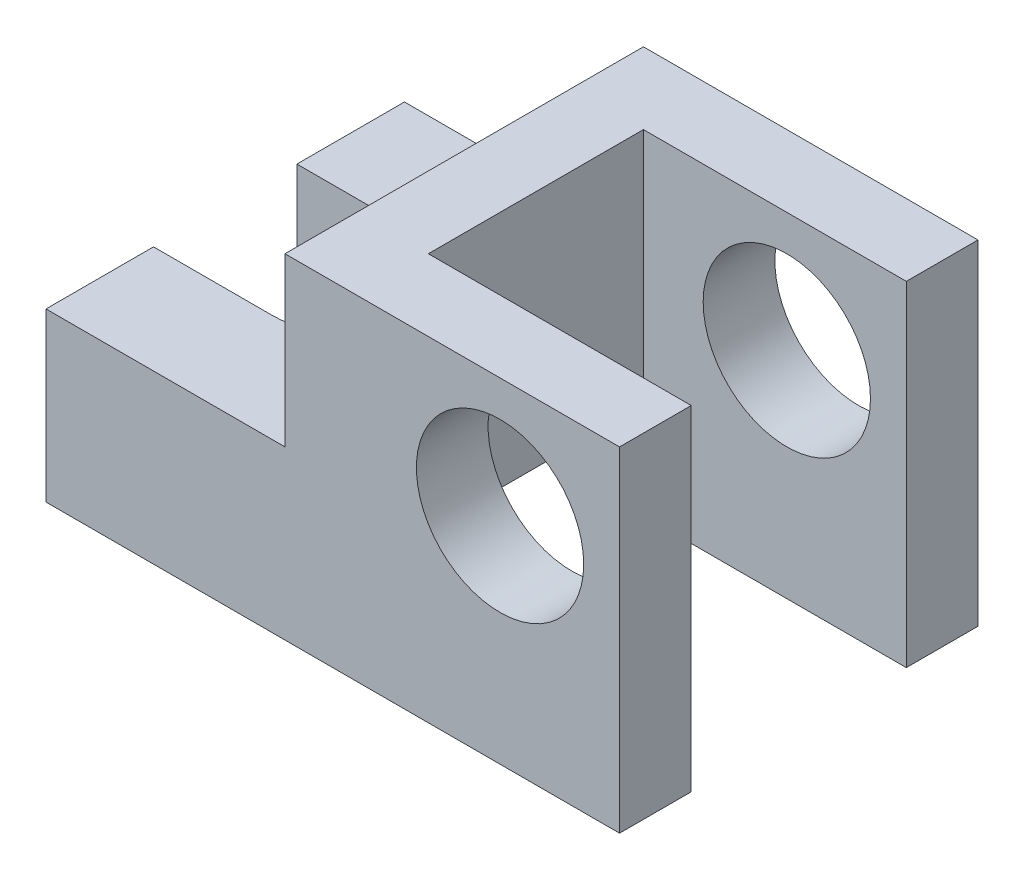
from build123d import *

# Parameters (mm, degrees)
SKETCH_1_W          = 48
SKETCH_1_H          = 30
EXTRUDE_1_DEPTH     = 14
CUT_EXTRUDE_1_DEPTH = 59.309518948
SKETCH_3_W          = 18
SKETCH_3_H          = 8
CUT_EXTRUDE_2_DEPTH = 59.309518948
SKETCH_4_W          = 28
SKETCH_4_H          = 30
EXTRUDE_2_DEPTH     = 14
SKETCH_5_W          = 22
SKETCH_5_H          = 18
CUT_EXTRUDE_3_DEPTH = 64.150613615
SKETCH_6_R          = 7
CUT_EXTRUDE_4_DEPTH = 64.150613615


with BuildPart() as part:
    # Sketch 1 → Extrude 1 (new body)
    with BuildSketch(Plane(origin=(0, 0, 0), x_dir=(1, 0, 0), z_dir=(0, 1, 0))):
        with Locations((24, 15)):
            Rectangle(SKETCH_1_W, SKETCH_1_H)
    extrude(amount=EXTRUDE_1_DEPTH)

    # Sketch 2 → Cut-Extrude 1 (cut, through all)
    with BuildSketch(Plane(origin=(0, 14, 0), x_dir=(1, 0, 0), z_dir=(0, 1, 0))):
        with BuildLine():
            Line((0, 9), (10, 9))
            ThreePointArc((10, 9), (16, 15), (10, 21))
            Line((10, 21), (0, 21))
            ThreePointArc((0, 21), (-6, 15), (0, 9))
        make_face()
    extrude(amount=-CUT_EXTRUDE_1_DEPTH, mode=Mode.SUBTRACT)

    # Sketch 3 → Cut-Extrude 2 (cut, through all)
    with BuildSketch(Plane.ZY):
        with Locations((-15, 4)):
            Rectangle(SKETCH_3_W, SKETCH_3_H)
    extrude(amount=-CUT_EXTRUDE_2_DEPTH, mode=Mode.SUBTRACT)

    # Sketch 4 → Extrude 2 (add)
    with BuildSketch(Plane(origin=(0, 14, 0), x_dir=(1, 0, 0), z_dir=(0, 1, 0))):
        with Locations((34, 15)):
            Rectangle(SKETCH_4_W, SKETCH_4_H)
    extrude(amount=EXTRUDE_2_DEPTH)

    # Sketch 5 → Cut-Extrude 3 (cut, through all)
    with BuildSketch(Plane(origin=(0, 28, 0), x_dir=(1, 0, 0), z_dir=(0, 1, 0))):
        with Locations((37, 15)):
            Rectangle(SKETCH_5_W, SKETCH_5_H)
    extrude(amount=-CUT_EXTRUDE_3_DEPTH, mode=Mode.SUBTRACT)

    # Sketch 6 → Cut-Extrude 4 (cut, through all)
    with BuildSketch(Plane.XY):
        with Locations((38, 18)):
            Circle(SKETCH_6_R)
    extrude(amount=-CUT_EXTRUDE_4_DEPTH, mode=Mode.SUBTRACT)


solid = part.part
